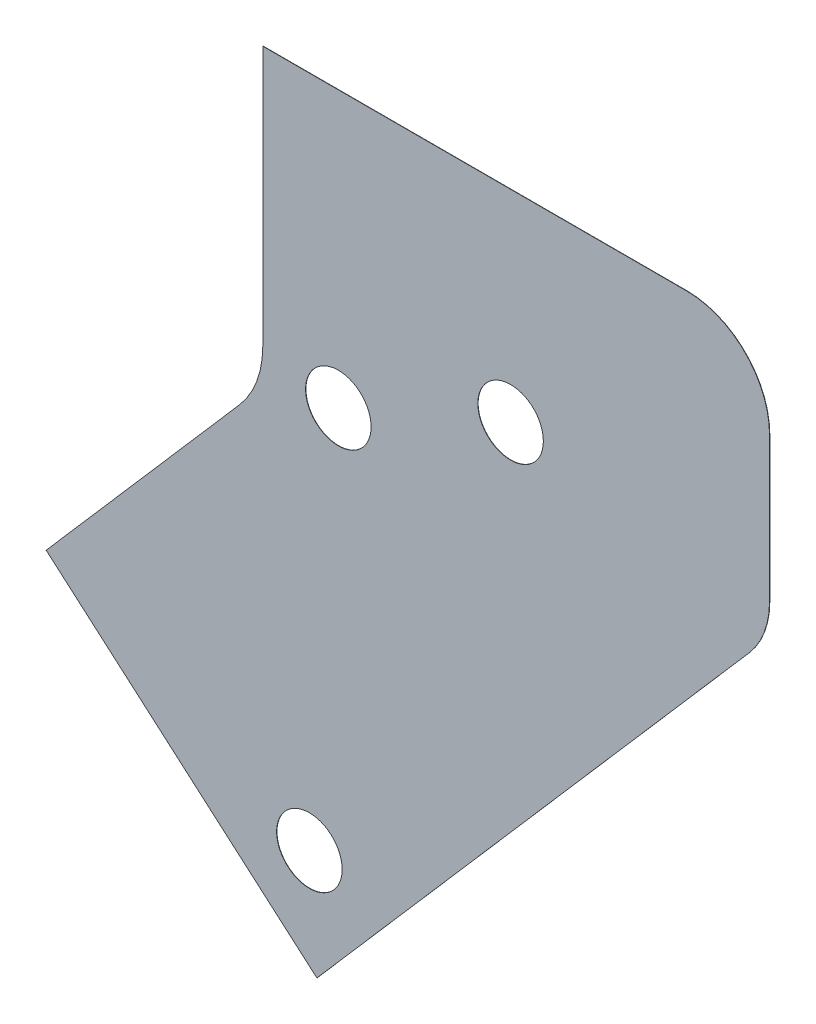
ISO-10303-21;
HEADER;
FILE_DESCRIPTION(('STEP AP214'),'2;1');
FILE_NAME('part.step','',(''),(''),'','','');
FILE_SCHEMA(('AUTOMOTIVE_DESIGN { 1 0 10303 214 1 1 1 1 }'));
ENDSEC;
DATA;
#1=APPLICATION_CONTEXT('core data for automotive mechanical design processes');
#2=APPLICATION_PROTOCOL_DEFINITION('international standard','automotive_design',2000,#1);
#3=PRODUCT_CONTEXT('',#1,'mechanical');
#4=PRODUCT('Part','Part','',(#3));
#5=PRODUCT_RELATED_PRODUCT_CATEGORY('part','',(#4));
#6=PRODUCT_DEFINITION_FORMATION('','',#4);
#7=PRODUCT_DEFINITION_CONTEXT('part definition',#1,'design');
#8=PRODUCT_DEFINITION('design','',#6,#7);
#9=PRODUCT_DEFINITION_SHAPE('','',#8);
#10=(LENGTH_UNIT() NAMED_UNIT(*) SI_UNIT(.MILLI.,.METRE.));
#11=(NAMED_UNIT(*) PLANE_ANGLE_UNIT() SI_UNIT($,.RADIAN.));
#12=(NAMED_UNIT(*) SI_UNIT($,.STERADIAN.) SOLID_ANGLE_UNIT());
#13=UNCERTAINTY_MEASURE_WITH_UNIT(LENGTH_MEASURE(1.E-05),#10,'distance_accuracy_value','');
#14=(GEOMETRIC_REPRESENTATION_CONTEXT(3) GLOBAL_UNCERTAINTY_ASSIGNED_CONTEXT((#13)) GLOBAL_UNIT_ASSIGNED_CONTEXT((#10,
#11,#12)) REPRESENTATION_CONTEXT('',''));
#15=CARTESIAN_POINT('',(0.,0.,0.));
#16=DIRECTION('',(0.,0.,1.));
#17=DIRECTION('',(1.,0.,0.));
#18=AXIS2_PLACEMENT_3D('',#15,#16,#17);
#19=CARTESIAN_POINT('',(-681.633022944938,-60.4053216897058,0.0254000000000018));
#20=DIRECTION('',(0.655690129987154,0.755030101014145,0.));
#21=DIRECTION('',(-0.755030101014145,0.655690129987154,0.));
#22=AXIS2_PLACEMENT_3D('',#19,#20,#21);
#23=PLANE('',#22);
#24=DIRECTION('',(0.755030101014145,-0.655690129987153,0.));
#25=VECTOR('',#24,1.);
#26=CARTESIAN_POINT('',(-681.633022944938,-60.4053216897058,0.));
#27=LINE('',#26,#25);
#28=CARTESIAN_POINT('',(-681.633022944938,-60.4053216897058,0.));
#29=VERTEX_POINT('',#28);
#30=CARTESIAN_POINT('',(-658.427927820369,-80.557302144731,0.));
#31=VERTEX_POINT('',#30);
#32=EDGE_CURVE('E153',#29,#31,#27,.T.);
#33=ORIENTED_EDGE('',*,*,#32,.T.);
#34=DIRECTION('',(0.,0.,-1.));
#35=VECTOR('',#34,1.);
#36=CARTESIAN_POINT('',(-658.427927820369,-80.557302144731,0.0254000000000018));
#37=LINE('',#36,#35);
#38=CARTESIAN_POINT('',(-658.427927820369,-80.557302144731,0.0254000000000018));
#39=VERTEX_POINT('',#38);
#40=EDGE_CURVE('E11',#39,#31,#37,.T.);
#41=ORIENTED_EDGE('',*,*,#40,.F.);
#42=DIRECTION('',(0.755030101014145,-0.655690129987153,0.));
#43=VECTOR('',#42,1.);
#44=CARTESIAN_POINT('',(-681.633022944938,-60.4053216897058,0.0254000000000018));
#45=LINE('',#44,#43);
#46=CARTESIAN_POINT('',(-681.633022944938,-60.4053216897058,0.0254000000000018));
#47=VERTEX_POINT('',#46);
#48=EDGE_CURVE('E179',#47,#39,#45,.T.);
#49=ORIENTED_EDGE('',*,*,#48,.F.);
#50=DIRECTION('',(0.,0.,-1.));
#51=VECTOR('',#50,1.);
#52=CARTESIAN_POINT('',(-681.633022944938,-60.4053216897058,0.0254000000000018));
#53=LINE('',#52,#51);
#54=EDGE_CURVE('E149',#47,#29,#53,.T.);
#55=ORIENTED_EDGE('',*,*,#54,.T.);
#56=EDGE_LOOP('',(#33,#41,#49,#55));
#57=FACE_BOUND('',#56,.T.);
#58=ADVANCED_FACE('F45',(#57),#23,.F.);
#59=CARTESIAN_POINT('',(-658.427927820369,-80.557302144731,0.0254000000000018));
#60=DIRECTION('',(-0.755030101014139,0.65569012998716,0.));
#61=DIRECTION('',(-0.65569012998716,-0.755030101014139,0.));
#62=AXIS2_PLACEMENT_3D('',#59,#60,#61);
#63=PLANE('',#62);
#64=DIRECTION('',(0.65569012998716,0.755030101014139,0.));
#65=VECTOR('',#64,1.);
#66=CARTESIAN_POINT('',(-658.427927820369,-80.557302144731,0.));
#67=LINE('',#66,#65);
#68=CARTESIAN_POINT('',(-621.375225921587,-37.8909511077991,0.));
#69=VERTEX_POINT('',#68);
#70=EDGE_CURVE('E157',#31,#69,#67,.T.);
#71=ORIENTED_EDGE('',*,*,#70,.T.);
#72=DIRECTION('',(0.,0.,-1.));
#73=VECTOR('',#72,1.);
#74=CARTESIAN_POINT('',(-621.375225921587,-37.8909511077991,0.0254000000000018));
#75=LINE('',#74,#73);
#76=CARTESIAN_POINT('',(-621.375225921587,-37.8909511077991,0.0254000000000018));
#77=VERTEX_POINT('',#76);
#78=EDGE_CURVE('E54',#77,#69,#75,.T.);
#79=ORIENTED_EDGE('',*,*,#78,.F.);
#80=DIRECTION('',(0.65569012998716,0.755030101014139,0.));
#81=VECTOR('',#80,1.);
#82=CARTESIAN_POINT('',(-658.427927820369,-80.557302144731,0.0254000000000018));
#83=LINE('',#82,#81);
#84=EDGE_CURVE('E108',#39,#77,#83,.T.);
#85=ORIENTED_EDGE('',*,*,#84,.F.);
#86=ORIENTED_EDGE('',*,*,#40,.T.);
#87=EDGE_LOOP('',(#71,#79,#85,#86));
#88=FACE_BOUND('',#87,.T.);
#89=ADVANCED_FACE('F290',(#88),#63,.F.);
#90=CARTESIAN_POINT('',(-626.745,-33.2276829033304,0.0254000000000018));
#91=DIRECTION('',(0.,0.,-1.));
#92=DIRECTION('',(-1.,0.,0.));
#93=AXIS2_PLACEMENT_3D('',#90,#91,#92);
#94=CYLINDRICAL_SURFACE('',#93,7.112);
#95=CARTESIAN_POINT('',(-626.745,-33.2276829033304,0.));
#96=DIRECTION('',(0.,0.,1.));
#97=DIRECTION('',(1.,0.,0.));
#98=AXIS2_PLACEMENT_3D('',#95,#96,#97);
#99=CIRCLE('',#98,7.112);
#100=CARTESIAN_POINT('',(-619.633,-33.2276829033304,0.));
#101=VERTEX_POINT('',#100);
#102=EDGE_CURVE('E161',#69,#101,#99,.T.);
#103=ORIENTED_EDGE('',*,*,#102,.T.);
#104=DIRECTION('',(0.,0.,-1.));
#105=VECTOR('',#104,1.);
#106=CARTESIAN_POINT('',(-619.633,-33.2276829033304,0.0254000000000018));
#107=LINE('',#106,#105);
#108=CARTESIAN_POINT('',(-619.633,-33.2276829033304,0.0254000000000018));
#109=VERTEX_POINT('',#108);
#110=EDGE_CURVE('E194',#109,#101,#107,.T.);
#111=ORIENTED_EDGE('',*,*,#110,.F.);
#112=CARTESIAN_POINT('',(-626.745,-33.2276829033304,0.0254000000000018));
#113=DIRECTION('',(0.,0.,1.));
#114=DIRECTION('',(1.,0.,0.));
#115=AXIS2_PLACEMENT_3D('',#112,#113,#114);
#116=CIRCLE('',#115,7.112);
#117=EDGE_CURVE('E205',#77,#109,#116,.T.);
#118=ORIENTED_EDGE('',*,*,#117,.F.);
#119=ORIENTED_EDGE('',*,*,#78,.T.);
#120=EDGE_LOOP('',(#103,#111,#118,#119));
#121=FACE_BOUND('',#120,.T.);
#122=ADVANCED_FACE('F203',(#121),#94,.T.);
#123=CARTESIAN_POINT('',(-619.633,-33.2276829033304,0.0254000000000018));
#124=DIRECTION('',(-1.,0.,0.));
#125=DIRECTION('',(0.,0.,1.));
#126=AXIS2_PLACEMENT_3D('',#123,#124,#125);
#127=PLANE('',#126);
#128=DIRECTION('',(0.,1.,0.));
#129=VECTOR('',#128,1.);
#130=CARTESIAN_POINT('',(-619.633,-33.2276829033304,0.));
#131=LINE('',#130,#129);
#132=CARTESIAN_POINT('',(-619.633,-20.8198728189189,0.));
#133=VERTEX_POINT('',#132);
#134=EDGE_CURVE('E164',#101,#133,#131,.T.);
#135=ORIENTED_EDGE('',*,*,#134,.T.);
#136=DIRECTION('',(0.,0.,-1.));
#137=VECTOR('',#136,1.);
#138=CARTESIAN_POINT('',(-619.633,-20.8198728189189,0.0254000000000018));
#139=LINE('',#138,#137);
#140=CARTESIAN_POINT('',(-619.633,-20.8198728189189,0.0254000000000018));
#141=VERTEX_POINT('',#140);
#142=EDGE_CURVE('E190',#141,#133,#139,.T.);
#143=ORIENTED_EDGE('',*,*,#142,.F.);
#144=DIRECTION('',(0.,1.,0.));
#145=VECTOR('',#144,1.);
#146=CARTESIAN_POINT('',(-619.633,-33.2276829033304,0.0254000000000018));
#147=LINE('',#146,#145);
#148=EDGE_CURVE('E222',#109,#141,#147,.T.);
#149=ORIENTED_EDGE('',*,*,#148,.F.);
#150=ORIENTED_EDGE('',*,*,#110,.T.);
#151=EDGE_LOOP('',(#135,#143,#149,#150));
#152=FACE_BOUND('',#151,.T.);
#153=ADVANCED_FACE('F214',(#152),#127,.F.);
#154=CARTESIAN_POINT('',(-626.745,-20.8198728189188,0.0254000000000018));
#155=DIRECTION('',(0.,0.,-1.));
#156=DIRECTION('',(-1.,0.,0.));
#157=AXIS2_PLACEMENT_3D('',#154,#155,#156);
#158=CYLINDRICAL_SURFACE('',#157,7.11199999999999);
#159=CARTESIAN_POINT('',(-626.745,-20.8198728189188,0.));
#160=DIRECTION('',(0.,0.,1.));
#161=DIRECTION('',(1.,0.,0.));
#162=AXIS2_PLACEMENT_3D('',#159,#160,#161);
#163=CIRCLE('',#162,7.11199999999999);
#164=CARTESIAN_POINT('',(-626.745,-13.7078728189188,0.));
#165=VERTEX_POINT('',#164);
#166=EDGE_CURVE('E167',#133,#165,#163,.T.);
#167=ORIENTED_EDGE('',*,*,#166,.T.);
#168=DIRECTION('',(0.,0.,-1.));
#169=VECTOR('',#168,1.);
#170=CARTESIAN_POINT('',(-626.745,-13.7078728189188,0.0254000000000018));
#171=LINE('',#170,#169);
#172=CARTESIAN_POINT('',(-626.745,-13.7078728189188,0.0254000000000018));
#173=VERTEX_POINT('',#172);
#174=EDGE_CURVE('E186',#173,#165,#171,.T.);
#175=ORIENTED_EDGE('',*,*,#174,.F.);
#176=CARTESIAN_POINT('',(-626.745,-20.8198728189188,0.0254000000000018));
#177=DIRECTION('',(0.,0.,1.));
#178=DIRECTION('',(1.,0.,0.));
#179=AXIS2_PLACEMENT_3D('',#176,#177,#178);
#180=CIRCLE('',#179,7.11199999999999);
#181=EDGE_CURVE('E220',#141,#173,#180,.T.);
#182=ORIENTED_EDGE('',*,*,#181,.F.);
#183=ORIENTED_EDGE('',*,*,#142,.T.);
#184=EDGE_LOOP('',(#167,#175,#182,#183));
#185=FACE_BOUND('',#184,.T.);
#186=ADVANCED_FACE('F218',(#185),#158,.T.);
#187=CARTESIAN_POINT('',(-626.745,-13.7078728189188,0.0254000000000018));
#188=DIRECTION('',(0.,-1.,0.));
#189=DIRECTION('',(1.,0.,0.));
#190=AXIS2_PLACEMENT_3D('',#187,#188,#189);
#191=PLANE('',#190);
#192=DIRECTION('',(-1.,0.,0.));
#193=VECTOR('',#192,1.);
#194=CARTESIAN_POINT('',(-626.745,-13.7078728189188,0.));
#195=LINE('',#194,#193);
#196=CARTESIAN_POINT('',(-663.067,-13.7078728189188,0.));
#197=VERTEX_POINT('',#196);
#198=EDGE_CURVE('E170',#165,#197,#195,.T.);
#199=ORIENTED_EDGE('',*,*,#198,.T.);
#200=DIRECTION('',(0.,0.,-1.));
#201=VECTOR('',#200,1.);
#202=CARTESIAN_POINT('',(-663.067,-13.7078728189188,0.0254000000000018));
#203=LINE('',#202,#201);
#204=CARTESIAN_POINT('',(-663.067,-13.7078728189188,0.0254000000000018));
#205=VERTEX_POINT('',#204);
#206=EDGE_CURVE('E141',#205,#197,#203,.T.);
#207=ORIENTED_EDGE('',*,*,#206,.F.);
#208=DIRECTION('',(-1.,0.,0.));
#209=VECTOR('',#208,1.);
#210=CARTESIAN_POINT('',(-626.745,-13.7078728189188,0.0254000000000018));
#211=LINE('',#210,#209);
#212=EDGE_CURVE('E130',#173,#205,#211,.T.);
#213=ORIENTED_EDGE('',*,*,#212,.F.);
#214=ORIENTED_EDGE('',*,*,#174,.T.);
#215=EDGE_LOOP('',(#199,#207,#213,#214));
#216=FACE_BOUND('',#215,.T.);
#217=ADVANCED_FACE('F298',(#216),#191,.F.);
#218=CARTESIAN_POINT('',(-663.067,-13.7078728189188,0.0254000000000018));
#219=DIRECTION('',(1.,0.,0.));
#220=DIRECTION('',(0.,1.,0.));
#221=AXIS2_PLACEMENT_3D('',#218,#219,#220);
#222=PLANE('',#221);
#223=DIRECTION('',(0.,-1.,0.));
#224=VECTOR('',#223,1.);
#225=CARTESIAN_POINT('',(-663.067,-13.7078728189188,0.));
#226=LINE('',#225,#224);
#227=CARTESIAN_POINT('',(-663.067,-35.989792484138,0.));
#228=VERTEX_POINT('',#227);
#229=EDGE_CURVE('E139',#197,#228,#226,.T.);
#230=ORIENTED_EDGE('',*,*,#229,.T.);
#231=DIRECTION('',(0.,0.,-1.));
#232=VECTOR('',#231,1.);
#233=CARTESIAN_POINT('',(-663.067,-35.989792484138,0.0254000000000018));
#234=LINE('',#233,#232);
#235=CARTESIAN_POINT('',(-663.067,-35.989792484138,0.0254000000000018));
#236=VERTEX_POINT('',#235);
#237=EDGE_CURVE('E136',#236,#228,#234,.T.);
#238=ORIENTED_EDGE('',*,*,#237,.F.);
#239=DIRECTION('',(0.,-1.,0.));
#240=VECTOR('',#239,1.);
#241=CARTESIAN_POINT('',(-663.067,-13.7078728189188,0.0254000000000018));
#242=LINE('',#241,#240);
#243=EDGE_CURVE('E124',#205,#236,#242,.T.);
#244=ORIENTED_EDGE('',*,*,#243,.F.);
#245=ORIENTED_EDGE('',*,*,#206,.T.);
#246=EDGE_LOOP('',(#230,#238,#244,#245));
#247=FACE_BOUND('',#246,.T.);
#248=ADVANCED_FACE('F137',(#247),#222,.F.);
#249=CARTESIAN_POINT('',(-671.195,-35.989792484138,0.0254000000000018));
#250=DIRECTION('',(0.,0.,-1.));
#251=DIRECTION('',(-1.,0.,0.));
#252=AXIS2_PLACEMENT_3D('',#249,#250,#251);
#253=CYLINDRICAL_SURFACE('',#252,8.12799999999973);
#254=CARTESIAN_POINT('',(-671.195,-35.989792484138,0.));
#255=DIRECTION('',(0.,0.,-1.));
#256=DIRECTION('',(1.,0.,0.));
#257=AXIS2_PLACEMENT_3D('',#254,#255,#256);
#258=CIRCLE('',#257,8.12799999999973);
#259=CARTESIAN_POINT('',(-665.058115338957,-41.3192418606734,0.));
#260=VERTEX_POINT('',#259);
#261=EDGE_CURVE('E94',#228,#260,#258,.T.);
#262=ORIENTED_EDGE('',*,*,#261,.T.);
#263=DIRECTION('',(0.,0.,-1.));
#264=VECTOR('',#263,1.);
#265=CARTESIAN_POINT('',(-665.058115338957,-41.3192418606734,0.0254000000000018));
#266=LINE('',#265,#264);
#267=CARTESIAN_POINT('',(-665.058115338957,-41.3192418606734,0.0254000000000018));
#268=VERTEX_POINT('',#267);
#269=EDGE_CURVE('E142',#268,#260,#266,.T.);
#270=ORIENTED_EDGE('',*,*,#269,.F.);
#271=CARTESIAN_POINT('',(-671.195,-35.989792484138,0.0254000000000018));
#272=DIRECTION('',(0.,0.,-1.));
#273=DIRECTION('',(1.,0.,0.));
#274=AXIS2_PLACEMENT_3D('',#271,#272,#273);
#275=CIRCLE('',#274,8.12799999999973);
#276=EDGE_CURVE('E128',#236,#268,#275,.T.);
#277=ORIENTED_EDGE('',*,*,#276,.F.);
#278=ORIENTED_EDGE('',*,*,#237,.T.);
#279=EDGE_LOOP('',(#262,#270,#277,#278));
#280=FACE_BOUND('',#279,.T.);
#281=ADVANCED_FACE('F144',(#280),#253,.F.);
#282=CARTESIAN_POINT('',(-665.058115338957,-41.3192418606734,0.0254000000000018));
#283=DIRECTION('',(0.75503010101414,-0.655690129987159,0.));
#284=DIRECTION('',(0.655690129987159,0.75503010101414,0.));
#285=AXIS2_PLACEMENT_3D('',#282,#283,#284);
#286=PLANE('',#285);
#287=DIRECTION('',(-0.655690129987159,-0.75503010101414,0.));
#288=VECTOR('',#287,1.);
#289=CARTESIAN_POINT('',(-665.058115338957,-41.3192418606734,0.));
#290=LINE('',#289,#288);
#291=EDGE_CURVE('E100',#260,#29,#290,.T.);
#292=ORIENTED_EDGE('',*,*,#291,.T.);
#293=ORIENTED_EDGE('',*,*,#54,.F.);
#294=DIRECTION('',(-0.655690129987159,-0.75503010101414,0.));
#295=VECTOR('',#294,1.);
#296=CARTESIAN_POINT('',(-665.058115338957,-41.3192418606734,0.0254000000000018));
#297=LINE('',#296,#295);
#298=EDGE_CURVE('E62',#268,#47,#297,.T.);
#299=ORIENTED_EDGE('',*,*,#298,.F.);
#300=ORIENTED_EDGE('',*,*,#269,.T.);
#301=EDGE_LOOP('',(#292,#293,#299,#300));
#302=FACE_BOUND('',#301,.T.);
#303=ADVANCED_FACE('F271',(#302),#286,.F.);
#304=CARTESIAN_POINT('',(-626.745,-33.2276829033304,0.0254000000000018));
#305=DIRECTION('',(0.,0.,1.));
#306=DIRECTION('',(1.,0.,0.));
#307=AXIS2_PLACEMENT_3D('',#304,#305,#306);
#308=PLANE('',#307);
#309=CARTESIAN_POINT('',(-659.071352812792,-71.4200672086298,0.0254000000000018));
#310=DIRECTION('',(0.,0.,1.));
#311=DIRECTION('',(1.,0.,0.));
#312=AXIS2_PLACEMENT_3D('',#309,#310,#311);
#313=CIRCLE('',#312,2.80670000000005);
#314=CARTESIAN_POINT('',(-656.264652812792,-71.4200672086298,0.0254000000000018));
#315=VERTEX_POINT('',#314);
#316=EDGE_CURVE('E250',#315,#315,#313,.T.);
#317=ORIENTED_EDGE('',*,*,#316,.F.);
#318=EDGE_LOOP('',(#317));
#319=FACE_BOUND('',#318,.T.);
#320=CARTESIAN_POINT('',(-656.590000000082,-37.329872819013,0.0254000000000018));
#321=DIRECTION('',(0.,0.,1.));
#322=DIRECTION('',(1.,0.,0.));
#323=AXIS2_PLACEMENT_3D('',#320,#321,#322);
#324=CIRCLE('',#323,2.80670000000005);
#325=CARTESIAN_POINT('',(-653.783300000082,-37.329872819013,0.0254000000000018));
#326=VERTEX_POINT('',#325);
#327=EDGE_CURVE('E242',#326,#326,#324,.T.);
#328=ORIENTED_EDGE('',*,*,#327,.F.);
#329=EDGE_LOOP('',(#328));
#330=FACE_BOUND('',#329,.T.);
#331=CARTESIAN_POINT('',(-641.825795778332,-31.0085922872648,0.0254000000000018));
#332=DIRECTION('',(0.,0.,1.));
#333=DIRECTION('',(1.,0.,0.));
#334=AXIS2_PLACEMENT_3D('',#331,#332,#333);
#335=CIRCLE('',#334,2.80670000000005);
#336=CARTESIAN_POINT('',(-639.019095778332,-31.0085922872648,0.0254000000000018));
#337=VERTEX_POINT('',#336);
#338=EDGE_CURVE('E158',#337,#337,#335,.T.);
#339=ORIENTED_EDGE('',*,*,#338,.F.);
#340=EDGE_LOOP('',(#339));
#341=FACE_BOUND('',#340,.T.);
#342=ORIENTED_EDGE('',*,*,#48,.T.);
#343=ORIENTED_EDGE('',*,*,#84,.T.);
#344=ORIENTED_EDGE('',*,*,#117,.T.);
#345=ORIENTED_EDGE('',*,*,#148,.T.);
#346=ORIENTED_EDGE('',*,*,#181,.T.);
#347=ORIENTED_EDGE('',*,*,#212,.T.);
#348=ORIENTED_EDGE('',*,*,#243,.T.);
#349=ORIENTED_EDGE('',*,*,#276,.T.);
#350=ORIENTED_EDGE('',*,*,#298,.T.);
#351=EDGE_LOOP('',(#342,#343,#344,#345,#346,#347,#348,#349,#350));
#352=FACE_BOUND('',#351,.T.);
#353=ADVANCED_FACE('F126',(#319,#330,#341,#352),#308,.T.);
#354=CARTESIAN_POINT('',(-626.745,-33.2276829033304,0.));
#355=DIRECTION('',(0.,0.,1.));
#356=DIRECTION('',(1.,0.,0.));
#357=AXIS2_PLACEMENT_3D('',#354,#355,#356);
#358=PLANE('',#357);
#359=CARTESIAN_POINT('',(-659.071352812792,-71.4200672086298,0.));
#360=DIRECTION('',(0.,0.,1.));
#361=DIRECTION('',(1.,0.,0.));
#362=AXIS2_PLACEMENT_3D('',#359,#360,#361);
#363=CIRCLE('',#362,2.80670000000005);
#364=CARTESIAN_POINT('',(-656.264652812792,-71.4200672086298,0.));
#365=VERTEX_POINT('',#364);
#366=EDGE_CURVE('E254',#365,#365,#363,.T.);
#367=ORIENTED_EDGE('',*,*,#366,.T.);
#368=EDGE_LOOP('',(#367));
#369=FACE_BOUND('',#368,.T.);
#370=CARTESIAN_POINT('',(-656.590000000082,-37.329872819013,0.));
#371=DIRECTION('',(0.,0.,1.));
#372=DIRECTION('',(1.,0.,0.));
#373=AXIS2_PLACEMENT_3D('',#370,#371,#372);
#374=CIRCLE('',#373,2.80670000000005);
#375=CARTESIAN_POINT('',(-653.783300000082,-37.329872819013,0.));
#376=VERTEX_POINT('',#375);
#377=EDGE_CURVE('E246',#376,#376,#374,.T.);
#378=ORIENTED_EDGE('',*,*,#377,.T.);
#379=EDGE_LOOP('',(#378));
#380=FACE_BOUND('',#379,.T.);
#381=CARTESIAN_POINT('',(-641.825795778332,-31.0085922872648,0.));
#382=DIRECTION('',(0.,0.,1.));
#383=DIRECTION('',(1.,0.,0.));
#384=AXIS2_PLACEMENT_3D('',#381,#382,#383);
#385=CIRCLE('',#384,2.80670000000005);
#386=CARTESIAN_POINT('',(-639.019095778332,-31.0085922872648,0.));
#387=VERTEX_POINT('',#386);
#388=EDGE_CURVE('E238',#387,#387,#385,.T.);
#389=ORIENTED_EDGE('',*,*,#388,.T.);
#390=EDGE_LOOP('',(#389));
#391=FACE_BOUND('',#390,.T.);
#392=ORIENTED_EDGE('',*,*,#32,.F.);
#393=ORIENTED_EDGE('',*,*,#291,.F.);
#394=ORIENTED_EDGE('',*,*,#261,.F.);
#395=ORIENTED_EDGE('',*,*,#229,.F.);
#396=ORIENTED_EDGE('',*,*,#198,.F.);
#397=ORIENTED_EDGE('',*,*,#166,.F.);
#398=ORIENTED_EDGE('',*,*,#134,.F.);
#399=ORIENTED_EDGE('',*,*,#102,.F.);
#400=ORIENTED_EDGE('',*,*,#70,.F.);
#401=EDGE_LOOP('',(#392,#393,#394,#395,#396,#397,#398,#399,#400));
#402=FACE_BOUND('',#401,.T.);
#403=ADVANCED_FACE('F209',(#369,#380,#391,#402),#358,.F.);
#404=CARTESIAN_POINT('',(-641.825795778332,-31.0085922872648,0.0254000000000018));
#405=DIRECTION('',(0.,0.,1.));
#406=DIRECTION('',(1.,0.,0.));
#407=AXIS2_PLACEMENT_3D('',#404,#405,#406);
#408=CYLINDRICAL_SURFACE('',#407,2.80670000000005);
#409=ORIENTED_EDGE('',*,*,#388,.F.);
#410=EDGE_LOOP('',(#409));
#411=FACE_BOUND('',#410,.T.);
#412=ORIENTED_EDGE('',*,*,#338,.T.);
#413=EDGE_LOOP('',(#412));
#414=FACE_BOUND('',#413,.T.);
#415=ADVANCED_FACE('F277',(#411,#414),#408,.F.);
#416=CARTESIAN_POINT('',(-656.590000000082,-37.329872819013,0.0254000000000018));
#417=DIRECTION('',(0.,0.,1.));
#418=DIRECTION('',(1.,0.,0.));
#419=AXIS2_PLACEMENT_3D('',#416,#417,#418);
#420=CYLINDRICAL_SURFACE('',#419,2.80670000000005);
#421=ORIENTED_EDGE('',*,*,#377,.F.);
#422=EDGE_LOOP('',(#421));
#423=FACE_BOUND('',#422,.T.);
#424=ORIENTED_EDGE('',*,*,#327,.T.);
#425=EDGE_LOOP('',(#424));
#426=FACE_BOUND('',#425,.T.);
#427=ADVANCED_FACE('F265',(#423,#426),#420,.F.);
#428=CARTESIAN_POINT('',(-659.071352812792,-71.4200672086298,0.0254000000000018));
#429=DIRECTION('',(0.,0.,1.));
#430=DIRECTION('',(1.,0.,0.));
#431=AXIS2_PLACEMENT_3D('',#428,#429,#430);
#432=CYLINDRICAL_SURFACE('',#431,2.80670000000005);
#433=ORIENTED_EDGE('',*,*,#366,.F.);
#434=EDGE_LOOP('',(#433));
#435=FACE_BOUND('',#434,.T.);
#436=ORIENTED_EDGE('',*,*,#316,.T.);
#437=EDGE_LOOP('',(#436));
#438=FACE_BOUND('',#437,.T.);
#439=ADVANCED_FACE('F262',(#435,#438),#432,.F.);
#440=CLOSED_SHELL('',(#58,#89,#122,#153,#186,#217,#248,#281,#303,#353,#403,#415,#427,#439));
#441=MANIFOLD_SOLID_BREP('B2',#440);
#442=ADVANCED_BREP_SHAPE_REPRESENTATION('',(#18,#441),#14);
#443=SHAPE_DEFINITION_REPRESENTATION(#9,#442);
ENDSEC;
END-ISO-10303-21;
